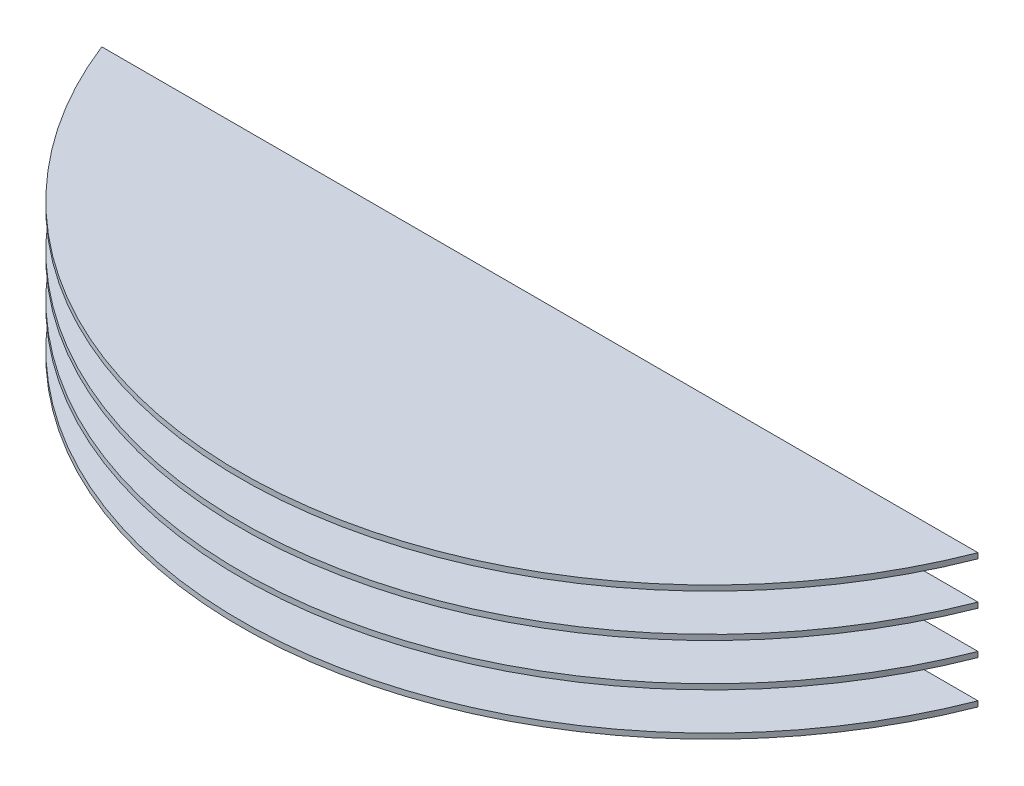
from build123d import *

# Parameters (mm, degrees)
SKETCH1_W          = 101.6
SKETCH1_H          = 1.5875
REVOLVE1_ANGLE     = 180
CUT_EXTRUDE1_DEPTH = 202.512475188


with BuildPart() as part:
    # Sketch1 → Revolve1 (revolve)
    with BuildSketch(Plane.XY):
        with Locations((-88.9, -8.73125)):
            Rectangle(SKETCH1_W, SKETCH1_H)
        with Locations((-88.9, 3.96875)):
            Rectangle(SKETCH1_W, SKETCH1_H)
        with Locations((-88.9, 16.66875)):
            Rectangle(SKETCH1_W, SKETCH1_H)
        with Locations((-88.9, 29.36875)):
            Rectangle(SKETCH1_W, SKETCH1_H)
    revolve(axis=Axis((0, -0.80239418, 0), (0, 1, 0)), revolution_arc=REVOLVE1_ANGLE)

    # Sketch2 → Cut-Extrude1 (cut, through all)
    with BuildSketch(Plane(origin=(0, 30.1625, 0), x_dir=(1, 0, 0), z_dir=(0, 1, 0))):
        Polygon((0, -50.8), (-185.623087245, -50.8), (-185.623087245, 0), (0, 0), (142.898646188, 0), (142.898646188, -50.8), align=None)
    extrude(amount=-CUT_EXTRUDE1_DEPTH, mode=Mode.SUBTRACT)


solid = part.part
